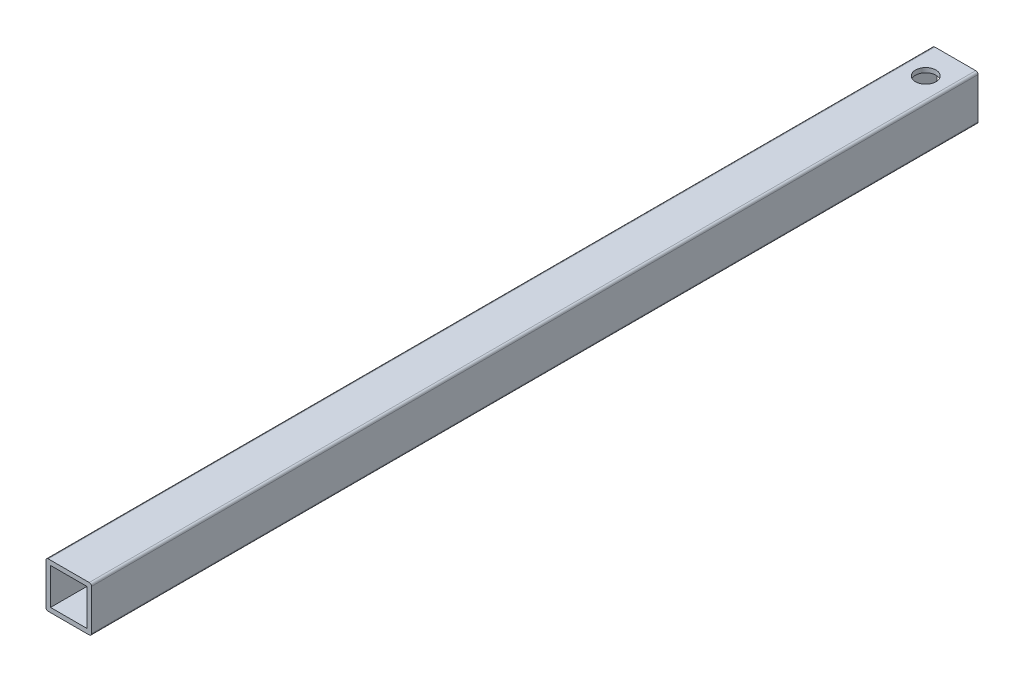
from build123d import *

# Parameters (mm, degrees)
ESQUISSE1_W             = 16
ESQUISSE1_H             = 16
BASE_EXTRU_MINCE_DEPTH  = 390
ESQUISSE2_R             = 4.5
ENL_V_MAT_EXTRU_1_DEPTH = 391.640499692


with BuildPart() as part:
    # Esquisse1 → Base-Extru.-Mince (new body)
    with BuildSketch(Plane.XY):
        with BuildLine():
            Line((9, -10), (-9, -10))
            ThreePointArc((-9, -10), (-9.707106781, -9.707106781), (-10, -9))
            Line((-10, -9), (-10, 9))
            ThreePointArc((-10, 9), (-9.707106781, 9.707106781), (-9, 10))
            Line((-9, 10), (9, 10))
            ThreePointArc((9, 10), (9.707106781, 9.707106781), (10, 9))
            Line((10, 9), (10, -9))
            ThreePointArc((10, -9), (9.707106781, -9.707106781), (9, -10))
        make_face()
        Rectangle(ESQUISSE1_W, ESQUISSE1_H, mode=Mode.SUBTRACT)
    extrude(amount=BASE_EXTRU_MINCE_DEPTH)

    # Esquisse2 → Enl_v. mat.-Extru.1 (cut, through all)
    with BuildSketch(Plane(origin=(0, 10, 0), x_dir=(-1, 0, 0), z_dir=(0, 1, 0))):
        with Locations(Location((0, 13, 0), (0, 0, 90))):
            Circle(ESQUISSE2_R)
    extrude(amount=-ENL_V_MAT_EXTRU_1_DEPTH, mode=Mode.SUBTRACT)


solid = part.part
